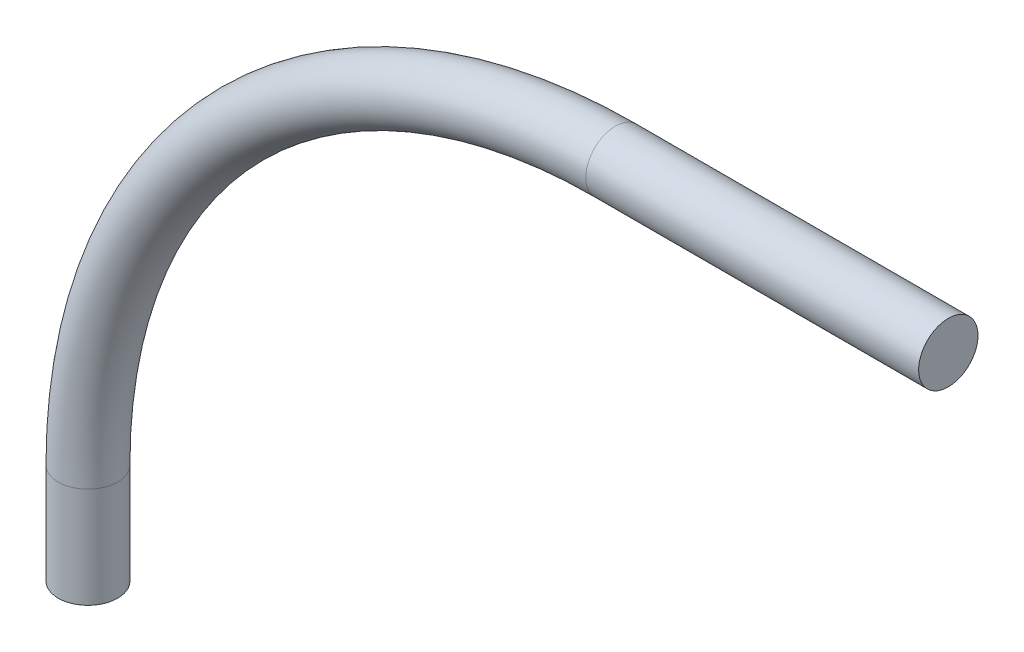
from build123d import *

# Parameters (mm, degrees)
SKETCH2_R = 21.25


with BuildPart() as part:
    # Sweep1: sweep along a path in Sketch1
    with BuildLine(Plane.XY) as sweep1_path:
        Line((-152, 278), (-152, 350))
        ThreePointArc((-152, 350), (-41.432809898, 616.932809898), (225.5, 727.5))
        Line((225.5, 727.5), (463.75, 727.5))
    # Sketch2 → Sweep1 (sweep)
    with BuildSketch(Plane.XZ.offset(-278)):
        with Locations((-152, 0)):
            Circle(SKETCH2_R)
    sweep(path=sweep1_path.line)


solid = part.part
